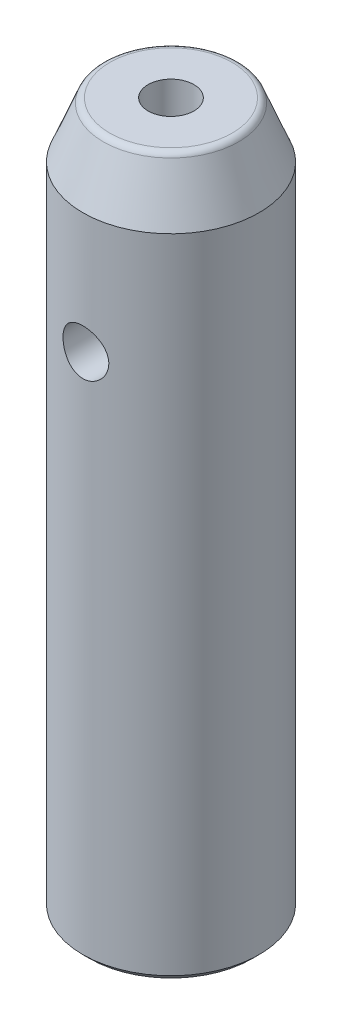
ISO-10303-21;
HEADER;
FILE_DESCRIPTION(('STEP AP214'),'2;1');
FILE_NAME('part.step','',(''),(''),'','','');
FILE_SCHEMA(('AUTOMOTIVE_DESIGN { 1 0 10303 214 1 1 1 1 }'));
ENDSEC;
DATA;
#1=APPLICATION_CONTEXT('core data for automotive mechanical design processes');
#2=APPLICATION_PROTOCOL_DEFINITION('international standard','automotive_design',2000,#1);
#3=PRODUCT_CONTEXT('',#1,'mechanical');
#4=PRODUCT('Part','Part','',(#3));
#5=PRODUCT_RELATED_PRODUCT_CATEGORY('part','',(#4));
#6=PRODUCT_DEFINITION_FORMATION('','',#4);
#7=PRODUCT_DEFINITION_CONTEXT('part definition',#1,'design');
#8=PRODUCT_DEFINITION('design','',#6,#7);
#9=PRODUCT_DEFINITION_SHAPE('','',#8);
#10=(LENGTH_UNIT() NAMED_UNIT(*) SI_UNIT(.MILLI.,.METRE.));
#11=(NAMED_UNIT(*) PLANE_ANGLE_UNIT() SI_UNIT($,.RADIAN.));
#12=(NAMED_UNIT(*) SI_UNIT($,.STERADIAN.) SOLID_ANGLE_UNIT());
#13=UNCERTAINTY_MEASURE_WITH_UNIT(LENGTH_MEASURE(1.E-05),#10,'distance_accuracy_value','');
#14=(GEOMETRIC_REPRESENTATION_CONTEXT(3) GLOBAL_UNCERTAINTY_ASSIGNED_CONTEXT((#13)) GLOBAL_UNIT_ASSIGNED_CONTEXT((#10,
#11,#12)) REPRESENTATION_CONTEXT('',''));
#15=CARTESIAN_POINT('',(0.,0.,0.));
#16=DIRECTION('',(0.,0.,1.));
#17=DIRECTION('',(1.,0.,0.));
#18=AXIS2_PLACEMENT_3D('',#15,#16,#17);
#19=CARTESIAN_POINT('',(0.,50.8,0.));
#20=DIRECTION('',(0.,-1.,0.));
#21=DIRECTION('',(0.,0.,-1.));
#22=AXIS2_PLACEMENT_3D('',#19,#20,#21);
#23=CYLINDRICAL_SURFACE('',#22,6.35);
#24=CARTESIAN_POINT('',(0.,39.75,-6.35));
#25=CARTESIAN_POINT('',(-0.0910448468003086,39.7499976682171,-6.34999855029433));
#26=CARTESIAN_POINT('',(-0.182115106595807,39.7424390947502,-6.34802256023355));
#27=CARTESIAN_POINT('',(-0.361637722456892,39.712454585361,-6.34033166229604));
#28=CARTESIAN_POINT('',(-0.450088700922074,39.690020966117,-6.33461482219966));
#29=CARTESIAN_POINT('',(-0.621755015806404,39.6310607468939,-6.32007407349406));
#30=CARTESIAN_POINT('',(-0.70497675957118,39.5945518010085,-6.3112540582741));
#31=CARTESIAN_POINT('',(-0.864115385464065,39.5085413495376,-6.29144207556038));
#32=CARTESIAN_POINT('',(-0.940031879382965,39.4590391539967,-6.28044999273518));
#33=CARTESIAN_POINT('',(-1.08408361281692,39.3472915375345,-6.25721162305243));
#34=CARTESIAN_POINT('',(-1.1520343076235,39.2848124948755,-6.2449447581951));
#35=CARTESIAN_POINT('',(-1.27662045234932,39.1493844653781,-6.22067339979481));
#36=CARTESIAN_POINT('',(-1.33325452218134,39.0764342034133,-6.20866893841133));
#37=CARTESIAN_POINT('',(-1.43448627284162,38.9206782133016,-6.18607236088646));
#38=CARTESIAN_POINT('',(-1.47887409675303,38.8377319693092,-6.17550627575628));
#39=CARTESIAN_POINT('',(-1.55300255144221,38.6652354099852,-6.15728432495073));
#40=CARTESIAN_POINT('',(-1.58274573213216,38.575686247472,-6.14962795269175));
#41=CARTESIAN_POINT('',(-1.62610440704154,38.3945636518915,-6.13830437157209));
#42=CARTESIAN_POINT('',(-1.6400533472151,38.3030753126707,-6.13455482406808));
#43=CARTESIAN_POINT('',(-1.65246676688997,38.1189861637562,-6.13122323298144));
#44=CARTESIAN_POINT('',(-1.65093398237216,38.0263855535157,-6.13164045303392));
#45=CARTESIAN_POINT('',(-1.63269273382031,37.8452833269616,-6.13652142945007));
#46=CARTESIAN_POINT('',(-1.61638516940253,37.7567379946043,-6.14087828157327));
#47=CARTESIAN_POINT('',(-1.56969829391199,37.5836852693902,-6.15297677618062));
#48=CARTESIAN_POINT('',(-1.53931790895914,37.4991781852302,-6.16071867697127));
#49=CARTESIAN_POINT('',(-1.46501490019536,37.335543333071,-6.17881066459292));
#50=CARTESIAN_POINT('',(-1.42094967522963,37.2564834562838,-6.18918799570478));
#51=CARTESIAN_POINT('',(-1.32062741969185,37.1067381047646,-6.2113666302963));
#52=CARTESIAN_POINT('',(-1.26436809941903,37.0360542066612,-6.22316820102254));
#53=CARTESIAN_POINT('',(-1.13919365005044,36.9027738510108,-6.2473127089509));
#54=CARTESIAN_POINT('',(-1.06994116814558,36.840494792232,-6.2596611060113));
#55=CARTESIAN_POINT('',(-0.921825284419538,36.7283711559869,-6.28318013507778));
#56=CARTESIAN_POINT('',(-0.842961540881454,36.6785270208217,-6.294350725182));
#57=CARTESIAN_POINT('',(-0.677386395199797,36.5925581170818,-6.31431860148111));
#58=CARTESIAN_POINT('',(-0.590645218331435,36.5564883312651,-6.32310633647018));
#59=CARTESIAN_POINT('',(-0.412050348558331,36.4995330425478,-6.33724917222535));
#60=CARTESIAN_POINT('',(-0.320197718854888,36.4786443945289,-6.34260498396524));
#61=CARTESIAN_POINT('',(-0.136698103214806,36.4531370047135,-6.34917395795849));
#62=CARTESIAN_POINT('',(-0.0451149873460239,36.4480864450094,-6.35049704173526));
#63=CARTESIAN_POINT('',(0.137588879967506,36.453209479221,-6.34916628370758));
#64=CARTESIAN_POINT('',(0.228709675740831,36.4633815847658,-6.34651283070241));
#65=CARTESIAN_POINT('',(0.406378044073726,36.4983062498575,-6.33759791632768));
#66=CARTESIAN_POINT('',(0.492975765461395,36.5228201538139,-6.33139554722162));
#67=CARTESIAN_POINT('',(0.660823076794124,36.585457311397,-6.31608436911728));
#68=CARTESIAN_POINT('',(0.742072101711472,36.6235820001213,-6.30697525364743));
#69=CARTESIAN_POINT('',(0.898610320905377,36.7131743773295,-6.28660102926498));
#70=CARTESIAN_POINT('',(0.973758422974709,36.7648798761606,-6.27529854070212));
#71=CARTESIAN_POINT('',(1.11446374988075,36.8798651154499,-6.25184511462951));
#72=CARTESIAN_POINT('',(1.18001917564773,36.9431470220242,-6.23969401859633));
#73=CARTESIAN_POINT('',(1.30148131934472,37.0814998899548,-6.21551205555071));
#74=CARTESIAN_POINT('',(1.3570840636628,37.1568402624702,-6.20349303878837));
#75=CARTESIAN_POINT('',(1.45486120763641,37.3160338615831,-6.18129455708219));
#76=CARTESIAN_POINT('',(1.49703618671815,37.3998867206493,-6.17111501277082));
#77=CARTESIAN_POINT('',(1.56644342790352,37.5732909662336,-6.1538633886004));
#78=CARTESIAN_POINT('',(1.59376344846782,37.6628053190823,-6.14677310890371));
#79=CARTESIAN_POINT('',(1.63290364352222,37.8453713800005,-6.13649272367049));
#80=CARTESIAN_POINT('',(1.64472753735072,37.9384222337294,-6.13330168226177));
#81=CARTESIAN_POINT('',(1.65233394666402,38.1223158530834,-6.13125643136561));
#82=CARTESIAN_POINT('',(1.64860385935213,38.2131373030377,-6.13227044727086));
#83=CARTESIAN_POINT('',(1.62633248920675,38.3928083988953,-6.13821413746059));
#84=CARTESIAN_POINT('',(1.60779155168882,38.4816580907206,-6.14314372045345));
#85=CARTESIAN_POINT('',(1.55670066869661,38.6542849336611,-6.15628671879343));
#86=CARTESIAN_POINT('',(1.52424906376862,38.7380930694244,-6.16447705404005));
#87=CARTESIAN_POINT('',(1.44633487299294,38.8991372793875,-6.18322034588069));
#88=CARTESIAN_POINT('',(1.40087034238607,38.9763723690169,-6.1937736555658));
#89=CARTESIAN_POINT('',(1.2967225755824,39.1244165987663,-6.2164235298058));
#90=CARTESIAN_POINT('',(1.23770439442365,39.1949847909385,-6.22855507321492));
#91=CARTESIAN_POINT('',(1.10876820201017,39.3253743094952,-6.25279366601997));
#92=CARTESIAN_POINT('',(1.03884757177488,39.3851930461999,-6.26490070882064));
#93=CARTESIAN_POINT('',(0.888403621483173,39.4935578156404,-6.28801547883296));
#94=CARTESIAN_POINT('',(0.807696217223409,39.5418544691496,-6.29899637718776));
#95=CARTESIAN_POINT('',(0.639026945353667,39.6241179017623,-6.31833266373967));
#96=CARTESIAN_POINT('',(0.551070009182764,39.6580943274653,-6.32668981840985));
#97=CARTESIAN_POINT('',(0.386139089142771,39.7060647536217,-6.33869137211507));
#98=CARTESIAN_POINT('',(0.30990819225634,39.7225033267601,-6.3429019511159));
#99=CARTESIAN_POINT('',(0.155790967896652,39.7444714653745,-6.34855676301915));
#100=CARTESIAN_POINT('',(0.0779047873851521,39.750001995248,-6.35000124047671));
#101=CARTESIAN_POINT('',(0.,39.75,-6.35));
#102=B_SPLINE_CURVE_WITH_KNOTS('',3,(#24,#25,#26,#27,#28,#29,#30,#31,#32,#33,#34,#35,#36,#37,
#38,#39,#40,#41,#42,#43,#44,#45,#46,#47,#48,#49,#50,#51,#52,#53,#54,#55,#56,#57,#58,#59,#60,#61,
#62,#63,#64,#65,#66,#67,#68,#69,#70,#71,#72,#73,#74,#75,#76,#77,#78,#79,#80,#81,#82,#83,#84,#85,
#86,#87,#88,#89,#90,#91,#92,#93,#94,#95,#96,#97,#98,#99,#100,#101),.UNSPECIFIED.,.T.,.F.,(4,2,2,
2,2,2,2,2,2,2,2,2,2,2,2,2,2,2,2,2,2,2,2,2,2,2,2,2,2,2,2,2,2,2,2,2,2,2,4),(0.,0.272848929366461,
0.545838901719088,0.818487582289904,1.09115074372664,1.36923066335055,1.64734447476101,
1.92996381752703,2.21253393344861,2.489020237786,2.76545768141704,3.03461179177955,
3.30378644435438,3.57586585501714,3.847996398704,4.1285359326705,4.40908544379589,
4.69074339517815,4.97234297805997,5.24619498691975,5.52002022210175,5.7894134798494,
6.05883515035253,6.33333182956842,6.60787992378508,6.88975050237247,7.17160891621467,
7.45178358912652,7.73189100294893,8.00328805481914,8.27467877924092,8.54418177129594,
8.81372506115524,9.09082731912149,9.3679962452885,9.65070850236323,9.93323000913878,
10.1667206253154,10.4001905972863),.UNSPECIFIED.);
#103=CARTESIAN_POINT('',(0.,39.75,-6.35));
#104=VERTEX_POINT('',#103);
#105=EDGE_CURVE('E71',#104,#104,#102,.T.);
#106=ORIENTED_EDGE('',*,*,#105,.T.);
#107=EDGE_LOOP('',(#106));
#108=FACE_BOUND('',#107,.T.);
#109=CARTESIAN_POINT('',(1.65,38.1,6.13188388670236));
#110=CARTESIAN_POINT('',(1.64999763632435,38.0090136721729,6.13188553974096));
#111=CARTESIAN_POINT('',(1.64244844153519,37.9180018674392,6.1339311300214));
#112=CARTESIAN_POINT('',(1.61250455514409,37.7386004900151,6.14186949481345));
#113=CARTESIAN_POINT('',(1.5901019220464,37.6502123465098,6.14776432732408));
#114=CARTESIAN_POINT('',(1.53123224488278,37.4786793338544,6.16268948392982));
#115=CARTESIAN_POINT('',(1.49478429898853,37.3955275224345,6.17171554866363));
#116=CARTESIAN_POINT('',(1.40891777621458,37.2365074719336,6.19188078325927));
#117=CARTESIAN_POINT('',(1.35949838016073,37.160639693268,6.20302008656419));
#118=CARTESIAN_POINT('',(1.24783688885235,37.01653888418,6.22645310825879));
#119=CARTESIAN_POINT('',(1.18534252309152,36.9485044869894,6.23876646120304));
#120=CARTESIAN_POINT('',(1.04984797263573,36.8237551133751,6.26299035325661));
#121=CARTESIAN_POINT('',(0.976846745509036,36.7670412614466,6.27490085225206));
#122=CARTESIAN_POINT('',(0.821040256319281,36.6657210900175,6.29719537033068));
#123=CARTESIAN_POINT('',(0.738103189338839,36.6213112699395,6.30755352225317));
#124=CARTESIAN_POINT('',(0.565626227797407,36.5471396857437,6.3253515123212));
#125=CARTESIAN_POINT('',(0.47608739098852,36.5173755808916,6.33279181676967));
#126=CARTESIAN_POINT('',(0.29502084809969,36.4739804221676,6.34377696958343));
#127=CARTESIAN_POINT('',(0.203579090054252,36.4600117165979,6.34740322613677));
#128=CARTESIAN_POINT('',(0.0195829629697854,36.4475425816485,6.35063594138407));
#129=CARTESIAN_POINT('',(-0.0729712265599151,36.4490396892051,6.35024304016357));
#130=CARTESIAN_POINT('',(-0.254218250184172,36.4672197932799,6.34554175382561));
#131=CARTESIAN_POINT('',(-0.342950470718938,36.4835381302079,6.34132739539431));
#132=CARTESIAN_POINT('',(-0.516371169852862,36.5303095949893,6.32956706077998));
#133=CARTESIAN_POINT('',(-0.601059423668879,36.5607635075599,6.32202089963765));
#134=CARTESIAN_POINT('',(-0.764931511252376,36.6352275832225,6.30430356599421));
#135=CARTESIAN_POINT('',(-0.844054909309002,36.6793646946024,6.29410796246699));
#136=CARTESIAN_POINT('',(-0.993897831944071,36.779845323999,6.27219339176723));
#137=CARTESIAN_POINT('',(-1.06461578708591,36.8361911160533,6.26047414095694));
#138=CARTESIAN_POINT('',(-1.19781633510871,36.9614334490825,6.23638166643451));
#139=CARTESIAN_POINT('',(-1.25999831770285,37.030648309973,6.22399933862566));
#140=CARTESIAN_POINT('',(-1.37194316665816,37.1786523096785,6.20028671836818));
#141=CARTESIAN_POINT('',(-1.42170535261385,37.2574419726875,6.18895648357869));
#142=CARTESIAN_POINT('',(-1.50761156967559,37.422984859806,6.16859596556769));
#143=CARTESIAN_POINT('',(-1.54367780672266,37.5097801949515,6.15957891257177));
#144=CARTESIAN_POINT('',(-1.60061006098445,37.6884943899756,6.14503216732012));
#145=CARTESIAN_POINT('',(-1.62147963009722,37.78041204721,6.139501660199));
#146=CARTESIAN_POINT('',(-1.64691605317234,37.9639600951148,6.13272673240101));
#147=CARTESIAN_POINT('',(-1.65192968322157,38.0555243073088,6.13136488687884));
#148=CARTESIAN_POINT('',(-1.6467396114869,38.2381820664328,6.13276088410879));
#149=CARTESIAN_POINT('',(-1.63653743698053,38.32927565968,6.13551831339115));
#150=CARTESIAN_POINT('',(-1.60159835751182,38.5067111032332,6.14472911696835));
#151=CARTESIAN_POINT('',(-1.57712648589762,38.5931089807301,6.15111504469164));
#152=CARTESIAN_POINT('',(-1.51463894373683,38.7605749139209,6.16679819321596));
#153=CARTESIAN_POINT('',(-1.47662157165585,38.8416422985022,6.17609577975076));
#154=CARTESIAN_POINT('',(-1.38720350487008,38.9980251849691,6.19679824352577));
#155=CARTESIAN_POINT('',(-1.33553846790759,39.0731841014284,6.20824328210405));
#156=CARTESIAN_POINT('',(-1.22062204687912,39.2139295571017,6.23185492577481));
#157=CARTESIAN_POINT('',(-1.15736859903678,39.2795143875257,6.24402165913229));
#158=CARTESIAN_POINT('',(-1.0190110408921,39.4010858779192,6.26810744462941));
#159=CARTESIAN_POINT('',(-0.943630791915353,39.4567620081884,6.28001069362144));
#160=CARTESIAN_POINT('',(-0.784333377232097,39.5546682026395,6.3018866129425));
#161=CARTESIAN_POINT('',(-0.700416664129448,39.5968989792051,6.31185938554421));
#162=CARTESIAN_POINT('',(-0.527016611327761,39.6663359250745,6.3286868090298));
#163=CARTESIAN_POINT('',(-0.437579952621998,39.6936528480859,6.33556437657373));
#164=CARTESIAN_POINT('',(-0.255181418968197,39.7328129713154,6.34552712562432));
#165=CARTESIAN_POINT('',(-0.16222028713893,39.7446594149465,6.34861310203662));
#166=CARTESIAN_POINT('',(0.0216806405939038,39.7523476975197,6.35060954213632));
#167=CARTESIAN_POINT('',(0.112600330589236,39.748646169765,6.34963914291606));
#168=CARTESIAN_POINT('',(0.29247572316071,39.726397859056,6.34389911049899));
#169=CARTESIAN_POINT('',(0.381431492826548,39.7078515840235,6.33912960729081));
#170=CARTESIAN_POINT('',(0.554334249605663,39.6566930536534,6.32634877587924));
#171=CARTESIAN_POINT('',(0.638309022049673,39.6241692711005,6.31835785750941));
#172=CARTESIAN_POINT('',(0.799657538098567,39.5460583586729,6.29997214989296));
#173=CARTESIAN_POINT('',(0.877030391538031,39.500469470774,6.2895770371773));
#174=CARTESIAN_POINT('',(1.02512119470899,39.3961626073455,6.26716709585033));
#175=CARTESIAN_POINT('',(1.09561856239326,39.3371389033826,6.25511766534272));
#176=CARTESIAN_POINT('',(1.22586275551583,39.2082234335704,6.23090349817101));
#177=CARTESIAN_POINT('',(1.28560679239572,39.1383288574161,6.21873873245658));
#178=CARTESIAN_POINT('',(1.39386165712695,38.9879245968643,6.19538429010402));
#179=CARTESIAN_POINT('',(1.44211599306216,38.9072260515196,6.18421983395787));
#180=CARTESIAN_POINT('',(1.52430254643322,38.7385820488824,6.16447892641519));
#181=CARTESIAN_POINT('',(1.55824457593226,38.6506416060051,6.15590070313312));
#182=CARTESIAN_POINT('',(1.60614388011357,38.4857937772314,6.14355741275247));
#183=CARTESIAN_POINT('',(1.62255248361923,38.4096329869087,6.13921421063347));
#184=CARTESIAN_POINT('',(1.64448100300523,38.2556542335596,6.13337688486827));
#185=CARTESIAN_POINT('',(1.6500020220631,38.1778364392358,6.13188247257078));
#186=CARTESIAN_POINT('',(1.65,38.1,6.13188388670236));
#187=B_SPLINE_CURVE_WITH_KNOTS('',3,(#109,#110,#111,#112,#113,#114,#115,#116,#117,#118,#119,
#120,#121,#122,#123,#124,#125,#126,#127,#128,#129,#130,#131,#132,#133,#134,#135,#136,#137,#138,
#139,#140,#141,#142,#143,#144,#145,#146,#147,#148,#149,#150,#151,#152,#153,#154,#155,#156,#157,
#158,#159,#160,#161,#162,#163,#164,#165,#166,#167,#168,#169,#170,#171,#172,#173,#174,#175,#176,
#177,#178,#179,#180,#181,#182,#183,#184,#185,#186),.UNSPECIFIED.,.T.,.F.,(4,2,2,2,2,2,2,2,2,2,2,
2,2,2,2,2,2,2,2,2,2,2,2,2,2,2,2,2,2,2,2,2,2,2,2,2,2,2,4),(0.,0.272672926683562,
0.545491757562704,0.817940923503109,1.09040729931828,1.36871710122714,1.64705453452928,
1.92960985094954,2.21211999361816,2.48846958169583,2.76477515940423,3.03446142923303,
3.30416267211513,3.57644504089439,3.84877816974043,4.12905991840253,4.40935701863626,
4.69122322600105,4.97302353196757,5.24680930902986,5.52056760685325,5.78939636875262,
6.05825891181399,6.33276889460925,6.60732781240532,6.88937426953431,7.1714057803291,
7.45131334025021,7.7311622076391,8.00285046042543,8.27452941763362,8.54451349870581,
8.81453392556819,9.09145439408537,9.36844657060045,9.65113942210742,9.93363815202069,
10.1669263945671,10.400190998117),.UNSPECIFIED.);
#188=CARTESIAN_POINT('',(1.65,38.1,6.13188388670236));
#189=VERTEX_POINT('',#188);
#190=EDGE_CURVE('E120',#189,#189,#187,.T.);
#191=ORIENTED_EDGE('',*,*,#190,.T.);
#192=EDGE_LOOP('',(#191));
#193=FACE_BOUND('',#192,.T.);
#194=CARTESIAN_POINT('',(0.,0.5,0.));
#195=DIRECTION('',(0.,1.,0.));
#196=DIRECTION('',(0.,0.,1.));
#197=AXIS2_PLACEMENT_3D('',#194,#195,#196);
#198=CIRCLE('',#197,6.35);
#199=CARTESIAN_POINT('',(0.,0.5,6.35));
#200=VERTEX_POINT('',#199);
#201=EDGE_CURVE('E51',#200,#200,#198,.T.);
#202=ORIENTED_EDGE('',*,*,#201,.T.);
#203=EDGE_LOOP('',(#202));
#204=FACE_BOUND('',#203,.T.);
#205=CARTESIAN_POINT('',(0.,46.7999999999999,0.));
#206=DIRECTION('',(0.,1.,0.));
#207=DIRECTION('',(0.,0.,1.));
#208=AXIS2_PLACEMENT_3D('',#205,#206,#207);
#209=CIRCLE('',#208,6.35);
#210=CARTESIAN_POINT('',(0.,46.7999999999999,6.35));
#211=VERTEX_POINT('',#210);
#212=EDGE_CURVE('E77',#211,#211,#209,.F.);
#213=ORIENTED_EDGE('',*,*,#212,.T.);
#214=EDGE_LOOP('',(#213));
#215=FACE_BOUND('',#214,.T.);
#216=ADVANCED_FACE('F39',(#108,#193,#204,#215),#23,.T.);
#217=CARTESIAN_POINT('',(0.,50.8,0.));
#218=DIRECTION('',(0.,1.,0.));
#219=DIRECTION('',(0.,0.,1.));
#220=AXIS2_PLACEMENT_3D('',#217,#218,#219);
#221=PLANE('',#220);
#222=CARTESIAN_POINT('',(0.,50.8,0.));
#223=DIRECTION('',(0.,1.,0.));
#224=DIRECTION('',(0.,0.,1.));
#225=AXIS2_PLACEMENT_3D('',#222,#223,#224);
#226=CIRCLE('',#225,4.41148351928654);
#227=CARTESIAN_POINT('',(0.,50.8,4.41148351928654));
#228=VERTEX_POINT('',#227);
#229=EDGE_CURVE('E80',#228,#228,#226,.T.);
#230=ORIENTED_EDGE('',*,*,#229,.T.);
#231=EDGE_LOOP('',(#230));
#232=FACE_BOUND('',#231,.T.);
#233=CARTESIAN_POINT('',(0.,50.8,0.));
#234=DIRECTION('',(0.,1.,0.));
#235=DIRECTION('',(0.,0.,1.));
#236=AXIS2_PLACEMENT_3D('',#233,#234,#235);
#237=CIRCLE('',#236,1.65);
#238=CARTESIAN_POINT('',(0.,50.8,1.65));
#239=VERTEX_POINT('',#238);
#240=EDGE_CURVE('E64',#239,#239,#237,.T.);
#241=ORIENTED_EDGE('',*,*,#240,.F.);
#242=EDGE_LOOP('',(#241));
#243=FACE_BOUND('',#242,.T.);
#244=ADVANCED_FACE('F104',(#232,#243),#221,.T.);
#245=CARTESIAN_POINT('',(0.,0.,0.));
#246=DIRECTION('',(0.,1.,0.));
#247=DIRECTION('',(0.,0.,1.));
#248=AXIS2_PLACEMENT_3D('',#245,#246,#247);
#249=PLANE('',#248);
#250=CARTESIAN_POINT('',(0.,0.,0.));
#251=DIRECTION('',(0.,1.,0.));
#252=DIRECTION('',(0.,0.,1.));
#253=AXIS2_PLACEMENT_3D('',#250,#251,#252);
#254=CIRCLE('',#253,5.85);
#255=CARTESIAN_POINT('',(0.,0.,5.85));
#256=VERTEX_POINT('',#255);
#257=EDGE_CURVE('E11',#256,#256,#254,.F.);
#258=ORIENTED_EDGE('',*,*,#257,.T.);
#259=EDGE_LOOP('',(#258));
#260=FACE_BOUND('',#259,.T.);
#261=CARTESIAN_POINT('',(0.,0.,0.));
#262=DIRECTION('',(0.,-1.,0.));
#263=DIRECTION('',(0.,0.,-1.));
#264=AXIS2_PLACEMENT_3D('',#261,#262,#263);
#265=CIRCLE('',#264,2.5);
#266=CARTESIAN_POINT('',(0.,0.,-2.5));
#267=VERTEX_POINT('',#266);
#268=EDGE_CURVE('E65',#267,#267,#265,.T.);
#269=ORIENTED_EDGE('',*,*,#268,.F.);
#270=EDGE_LOOP('',(#269));
#271=FACE_BOUND('',#270,.T.);
#272=ADVANCED_FACE('F110',(#260,#271),#249,.F.);
#273=CARTESIAN_POINT('',(0.,40.7,0.));
#274=DIRECTION('',(0.,1.,0.));
#275=DIRECTION('',(0.,0.,1.));
#276=AXIS2_PLACEMENT_3D('',#273,#274,#275);
#277=CONICAL_SURFACE('',#276,1.65,1.02974425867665);
#278=CARTESIAN_POINT('',(-0.0573261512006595,39.7490038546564,-0.0352116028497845));
#279=CARTESIAN_POINT('',(-0.0554022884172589,39.749070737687,-0.0385561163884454));
#280=CARTESIAN_POINT('',(-0.053198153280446,39.7491440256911,-0.0417422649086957));
#281=CARTESIAN_POINT('',(-0.0482828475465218,39.7492952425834,-0.0477003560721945));
#282=CARTESIAN_POINT('',(-0.0455711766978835,39.7493731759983,-0.0504718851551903));
#283=CARTESIAN_POINT('',(-0.039719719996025,39.7495244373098,-0.0555035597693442));
#284=CARTESIAN_POINT('',(-0.0365810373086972,39.749597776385,-0.0577649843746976));
#285=CARTESIAN_POINT('',(-0.0299586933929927,39.7497313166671,-0.0617075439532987));
#286=CARTESIAN_POINT('',(-0.0264751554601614,39.7497915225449,-0.0633888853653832));
#287=CARTESIAN_POINT('',(-0.0193829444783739,39.7498898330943,-0.0660675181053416));
#288=CARTESIAN_POINT('',(-0.0157819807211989,39.7499285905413,-0.0670852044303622));
#289=CARTESIAN_POINT('',(-0.00845849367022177,39.7499823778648,-0.0684855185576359));
#290=CARTESIAN_POINT('',(-0.00473598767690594,39.7499974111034,-0.0688682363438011));
#291=CARTESIAN_POINT('',(0.00263034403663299,39.7500019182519,-0.0689835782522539));
#292=CARTESIAN_POINT('',(0.00627394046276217,39.7499919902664,-0.0687314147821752));
#293=CARTESIAN_POINT('',(0.0134664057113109,39.7499489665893,-0.0676177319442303));
#294=CARTESIAN_POINT('',(0.0170152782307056,39.7499158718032,-0.0667562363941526));
#295=CARTESIAN_POINT('',(0.023911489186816,39.7498303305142,-0.0644556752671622));
#296=CARTESIAN_POINT('',(0.0272592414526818,39.7497779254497,-0.0630178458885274));
#297=CARTESIAN_POINT('',(0.0336722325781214,39.749659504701,-0.0596113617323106));
#298=CARTESIAN_POINT('',(0.0367374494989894,39.7495934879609,-0.0576426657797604));
#299=CARTESIAN_POINT('',(0.0425655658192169,39.7494535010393,-0.0531908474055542));
#300=CARTESIAN_POINT('',(0.0453212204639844,39.7493793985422,-0.050698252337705));
#301=CARTESIAN_POINT('',(0.0503905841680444,39.749232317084,-0.0452983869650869));
#302=CARTESIAN_POINT('',(0.0527042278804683,39.7491593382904,-0.0423910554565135));
#303=CARTESIAN_POINT('',(0.0569012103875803,39.7490199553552,-0.0361466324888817));
#304=CARTESIAN_POINT('',(0.0587687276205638,39.7489538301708,-0.0327989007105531));
#305=CARTESIAN_POINT('',(0.0619336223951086,39.7488379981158,-0.0258437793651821));
#306=CARTESIAN_POINT('',(0.0632309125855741,39.7487882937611,-0.0222363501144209));
#307=CARTESIAN_POINT('',(0.0652553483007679,39.7487094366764,-0.0147526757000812));
#308=CARTESIAN_POINT('',(0.0659649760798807,39.7486809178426,-0.0108716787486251));
#309=CARTESIAN_POINT('',(0.0667340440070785,39.7486499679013,-0.00304555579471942));
#310=CARTESIAN_POINT('',(0.0667934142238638,39.7486475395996,0.000899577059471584));
#311=CARTESIAN_POINT('',(0.0662563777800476,39.7486692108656,0.00880601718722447));
#312=CARTESIAN_POINT('',(0.0656498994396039,39.7486937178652,0.0127666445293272));
#313=CARTESIAN_POINT('',(0.0637790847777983,39.748767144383,0.020529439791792));
#314=CARTESIAN_POINT('',(0.0625147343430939,39.7488160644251,0.024331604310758));
#315=CARTESIAN_POINT('',(0.0593636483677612,39.7489325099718,0.0316538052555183));
#316=CARTESIAN_POINT('',(0.0574789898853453,39.7489999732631,0.0351747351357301));
#317=CARTESIAN_POINT('',(0.0531330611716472,39.7491457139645,0.0418408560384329));
#318=CARTESIAN_POINT('',(0.050671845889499,39.7492239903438,0.044986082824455));
#319=CARTESIAN_POINT('',(0.0452966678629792,39.7493802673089,0.0507363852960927));
#320=CARTESIAN_POINT('',(0.0423935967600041,39.7494582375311,0.0533516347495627));
#321=CARTESIAN_POINT('',(0.0361768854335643,39.7496062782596,0.0580380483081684));
#322=CARTESIAN_POINT('',(0.0328633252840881,39.7496763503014,0.060109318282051));
#323=CARTESIAN_POINT('',(0.0260345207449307,39.7497980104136,0.0635776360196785));
#324=CARTESIAN_POINT('',(0.0225292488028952,39.7498501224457,0.0649943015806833));
#325=CARTESIAN_POINT('',(0.0153262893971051,39.7499327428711,0.0671998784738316));
#326=CARTESIAN_POINT('',(0.0116286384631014,39.7499632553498,0.0679889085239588));
#327=CARTESIAN_POINT('',(0.00425845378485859,39.7499985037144,0.068897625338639));
#328=CARTESIAN_POINT('',(0.000588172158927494,39.7500039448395,0.0690356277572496));
#329=CARTESIAN_POINT('',(-0.00672239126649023,39.7499903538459,0.0686873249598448));
#330=CARTESIAN_POINT('',(-0.0103626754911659,39.7499713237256,0.0682010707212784));
#331=CARTESIAN_POINT('',(-0.0174742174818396,39.7499112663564,0.0666289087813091));
#332=CARTESIAN_POINT('',(-0.0209467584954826,39.7498704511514,0.0655487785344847));
#333=CARTESIAN_POINT('',(-0.0276647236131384,39.7497714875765,0.0628288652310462));
#334=CARTESIAN_POINT('',(-0.0309101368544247,39.7497133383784,0.0611890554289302));
#335=CARTESIAN_POINT('',(-0.037131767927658,39.7495851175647,0.0573756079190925));
#336=CARTESIAN_POINT('',(-0.0401036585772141,39.7495148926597,0.0551949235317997));
#337=CARTESIAN_POINT('',(-0.0456522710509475,39.7493706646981,0.0503787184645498));
#338=CARTESIAN_POINT('',(-0.0482289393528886,39.7492966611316,0.0477431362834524));
#339=CARTESIAN_POINT('',(-0.0529952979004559,39.7491504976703,0.0420098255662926));
#340=CARTESIAN_POINT('',(-0.0551713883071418,39.7490784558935,0.0389007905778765));
#341=CARTESIAN_POINT('',(-0.0589892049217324,39.7489463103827,0.0323703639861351));
#342=CARTESIAN_POINT('',(-0.0606308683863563,39.7488862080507,0.0289489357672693));
#343=CARTESIAN_POINT('',(-0.0633853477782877,39.7487826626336,0.021777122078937));
#344=CARTESIAN_POINT('',(-0.0644802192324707,39.7487397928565,0.0180198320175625));
#345=CARTESIAN_POINT('',(-0.0660384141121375,39.7486781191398,0.010375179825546));
#346=CARTESIAN_POINT('',(-0.0665015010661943,39.7486593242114,0.0064877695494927));
#347=CARTESIAN_POINT('',(-0.0667883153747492,39.7486477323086,-0.00139174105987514));
#348=CARTESIAN_POINT('',(-0.0665985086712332,39.7486554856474,-0.00538433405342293));
#349=CARTESIAN_POINT('',(-0.0655536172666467,39.7486973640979,-0.0132782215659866));
#350=CARTESIAN_POINT('',(-0.064699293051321,39.7487314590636,-0.0171796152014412));
#351=CARTESIAN_POINT('',(-0.0627577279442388,39.74880624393,-0.0234565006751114));
#352=CARTESIAN_POINT('',(-0.0618549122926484,39.7488405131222,-0.0258906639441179));
#353=CARTESIAN_POINT('',(-0.0597856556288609,39.7489168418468,-0.0306442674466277));
#354=CARTESIAN_POINT('',(-0.0586192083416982,39.7489589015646,-0.0329637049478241));
#355=CARTESIAN_POINT('',(-0.0573261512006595,39.7490038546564,-0.0352116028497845));
#356=B_SPLINE_CURVE_WITH_KNOTS('',3,(#278,#279,#280,#281,#282,#283,#284,#285,#286,#287,#288,
#289,#290,#291,#292,#293,#294,#295,#296,#297,#298,#299,#300,#301,#302,#303,#304,#305,#306,#307,
#308,#309,#310,#311,#312,#313,#314,#315,#316,#317,#318,#319,#320,#321,#322,#323,#324,#325,#326,
#327,#328,#329,#330,#331,#332,#333,#334,#335,#336,#337,#338,#339,#340,#341,#342,#343,#344,#345,
#346,#347,#348,#349,#350,#351,#352,#353,#354,#355),.UNSPECIFIED.,.T.,.F.,(4,2,2,2,2,2,2,2,2,2,2,
2,2,2,2,2,2,2,2,2,2,2,2,2,2,2,2,2,2,2,2,2,2,2,2,2,2,2,4),(0.,0.011567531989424,
0.0231465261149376,0.034696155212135,0.0462416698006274,0.0574131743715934,0.0685830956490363,
0.0794879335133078,0.0903923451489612,0.101273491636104,0.11215548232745,0.123254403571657,
0.134354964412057,0.145804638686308,0.15725606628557,0.169037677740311,0.180820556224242,
0.192784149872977,0.204748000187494,0.216672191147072,0.228595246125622,0.240261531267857,
0.251925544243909,0.2632127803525,0.274497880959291,0.285463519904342,0.296428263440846,
0.307288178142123,0.318148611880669,0.329158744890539,0.340170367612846,0.35150564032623,
0.362842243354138,0.374529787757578,0.386221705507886,0.398157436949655,0.410079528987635,
0.417854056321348,0.425628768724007),.UNSPECIFIED.);
#357=CARTESIAN_POINT('',(-0.0573261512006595,39.7490038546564,-0.0352116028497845));
#358=VERTEX_POINT('',#357);
#359=EDGE_CURVE('E43',#358,#358,#356,.T.);
#360=ORIENTED_EDGE('',*,*,#359,.T.);
#361=EDGE_LOOP('',(#360));
#362=FACE_BOUND('',#361,.T.);
#363=CARTESIAN_POINT('',(0.,40.7,0.));
#364=DIRECTION('',(0.,1.,0.));
#365=DIRECTION('',(0.,0.,1.));
#366=AXIS2_PLACEMENT_3D('',#363,#364,#365);
#367=CIRCLE('',#366,1.65);
#368=CARTESIAN_POINT('',(0.,40.7,1.65));
#369=VERTEX_POINT('',#368);
#370=EDGE_CURVE('E68',#369,#369,#367,.T.);
#371=ORIENTED_EDGE('',*,*,#370,.T.);
#372=EDGE_LOOP('',(#371));
#373=FACE_BOUND('',#372,.T.);
#374=ADVANCED_FACE('F132',(#362,#373),#277,.F.);
#375=CARTESIAN_POINT('',(0.,50.8,0.));
#376=DIRECTION('',(0.,1.,0.));
#377=DIRECTION('',(0.,0.,1.));
#378=AXIS2_PLACEMENT_3D('',#375,#376,#377);
#379=CYLINDRICAL_SURFACE('',#378,1.65);
#380=ORIENTED_EDGE('',*,*,#370,.F.);
#381=EDGE_LOOP('',(#380));
#382=FACE_BOUND('',#381,.T.);
#383=ORIENTED_EDGE('',*,*,#240,.T.);
#384=EDGE_LOOP('',(#383));
#385=FACE_BOUND('',#384,.T.);
#386=ADVANCED_FACE('F58',(#382,#385),#379,.F.);
#387=CARTESIAN_POINT('',(0.,11.,0.));
#388=DIRECTION('',(0.,-1.,0.));
#389=DIRECTION('',(0.,0.,-1.));
#390=AXIS2_PLACEMENT_3D('',#387,#388,#389);
#391=CONICAL_SURFACE('',#390,2.5,1.02974425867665);
#392=CARTESIAN_POINT('',(0.,12.5021515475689,0.));
#393=VERTEX_POINT('',#392);
#394=VERTEX_LOOP('',#393);
#395=FACE_BOUND('',#394,.T.);
#396=CARTESIAN_POINT('',(0.,11.,0.));
#397=DIRECTION('',(0.,-1.,0.));
#398=DIRECTION('',(0.,0.,-1.));
#399=AXIS2_PLACEMENT_3D('',#396,#397,#398);
#400=CIRCLE('',#399,2.5);
#401=CARTESIAN_POINT('',(0.,11.,-2.5));
#402=VERTEX_POINT('',#401);
#403=EDGE_CURVE('E62',#402,#402,#400,.T.);
#404=ORIENTED_EDGE('',*,*,#403,.T.);
#405=EDGE_LOOP('',(#404));
#406=FACE_BOUND('',#405,.T.);
#407=ADVANCED_FACE('F54',(#395,#406),#391,.F.);
#408=CARTESIAN_POINT('',(0.,0.,0.));
#409=DIRECTION('',(0.,-1.,0.));
#410=DIRECTION('',(0.,0.,-1.));
#411=AXIS2_PLACEMENT_3D('',#408,#409,#410);
#412=CYLINDRICAL_SURFACE('',#411,2.5);
#413=ORIENTED_EDGE('',*,*,#403,.F.);
#414=EDGE_LOOP('',(#413));
#415=FACE_BOUND('',#414,.T.);
#416=ORIENTED_EDGE('',*,*,#268,.T.);
#417=EDGE_LOOP('',(#416));
#418=FACE_BOUND('',#417,.T.);
#419=ADVANCED_FACE('F57',(#415,#418),#412,.F.);
#420=CARTESIAN_POINT('',(0.,50.8,0.));
#421=DIRECTION('',(0.,-1.,0.));
#422=DIRECTION('',(0.,0.,-1.));
#423=AXIS2_PLACEMENT_3D('',#420,#421,#422);
#424=CONICAL_SURFACE('',#423,4.74999999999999,0.380506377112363);
#425=CARTESIAN_POINT('',(0.,50.4856953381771,0.));
#426=DIRECTION('',(0.,1.,0.));
#427=DIRECTION('',(0.,0.,1.));
#428=AXIS2_PLACEMENT_3D('',#425,#426,#427);
#429=CIRCLE('',#428,4.87572186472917);
#430=CARTESIAN_POINT('',(0.,50.4856953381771,4.87572186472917));
#431=VERTEX_POINT('',#430);
#432=EDGE_CURVE('E83',#431,#431,#429,.F.);
#433=ORIENTED_EDGE('',*,*,#432,.T.);
#434=EDGE_LOOP('',(#433));
#435=FACE_BOUND('',#434,.T.);
#436=ORIENTED_EDGE('',*,*,#212,.F.);
#437=EDGE_LOOP('',(#436));
#438=FACE_BOUND('',#437,.T.);
#439=ADVANCED_FACE('F100',(#435,#438),#424,.T.);
#440=CARTESIAN_POINT('',(0.,50.3,0.));
#441=DIRECTION('',(0.,1.,0.));
#442=DIRECTION('',(0.,0.,1.));
#443=AXIS2_PLACEMENT_3D('',#440,#441,#442);
#444=TOROIDAL_SURFACE('',#443,4.41148351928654,0.5);
#445=ORIENTED_EDGE('',*,*,#432,.F.);
#446=EDGE_LOOP('',(#445));
#447=FACE_BOUND('',#446,.T.);
#448=ORIENTED_EDGE('',*,*,#229,.F.);
#449=EDGE_LOOP('',(#448));
#450=FACE_BOUND('',#449,.T.);
#451=ADVANCED_FACE('F93',(#447,#450),#444,.T.);
#452=CARTESIAN_POINT('',(0.,0.5,0.));
#453=DIRECTION('',(0.,1.,0.));
#454=DIRECTION('',(0.,0.,1.));
#455=AXIS2_PLACEMENT_3D('',#452,#453,#454);
#456=CONICAL_SURFACE('',#455,6.35,0.785398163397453);
#457=ORIENTED_EDGE('',*,*,#257,.F.);
#458=EDGE_LOOP('',(#457));
#459=FACE_BOUND('',#458,.T.);
#460=ORIENTED_EDGE('',*,*,#201,.F.);
#461=EDGE_LOOP('',(#460));
#462=FACE_BOUND('',#461,.T.);
#463=ADVANCED_FACE('F41',(#459,#462),#456,.T.);
#464=CARTESIAN_POINT('',(0.,38.1,-6.35));
#465=DIRECTION('',(0.,0.,1.));
#466=DIRECTION('',(1.,0.,0.));
#467=AXIS2_PLACEMENT_3D('',#464,#465,#466);
#468=CYLINDRICAL_SURFACE('',#467,1.65);
#469=ORIENTED_EDGE('',*,*,#359,.F.);
#470=EDGE_LOOP('',(#469));
#471=FACE_BOUND('',#470,.T.);
#472=ORIENTED_EDGE('',*,*,#190,.F.);
#473=EDGE_LOOP('',(#472));
#474=FACE_BOUND('',#473,.T.);
#475=ORIENTED_EDGE('',*,*,#105,.F.);
#476=EDGE_LOOP('',(#475));
#477=FACE_BOUND('',#476,.T.);
#478=ADVANCED_FACE('F92',(#471,#474,#477),#468,.F.);
#479=CLOSED_SHELL('',(#216,#244,#272,#374,#386,#407,#419,#439,#451,#463,#478));
#480=MANIFOLD_SOLID_BREP('B2',#479);
#481=ADVANCED_BREP_SHAPE_REPRESENTATION('',(#18,#480),#14);
#482=SHAPE_DEFINITION_REPRESENTATION(#9,#481);
ENDSEC;
END-ISO-10303-21;
